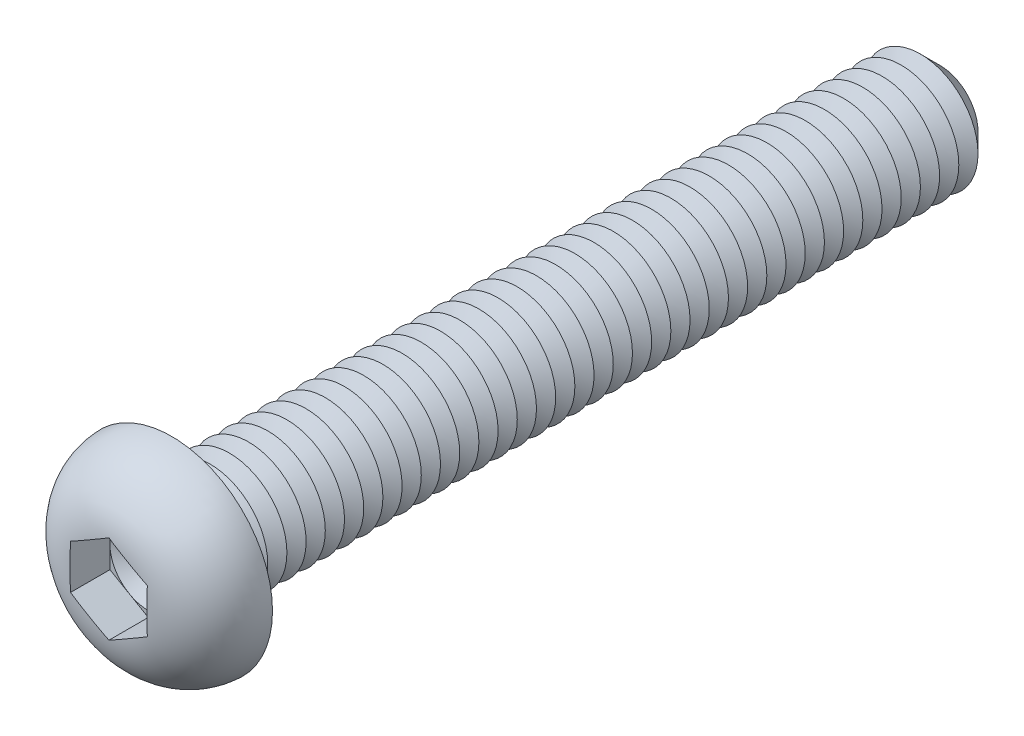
from build123d import *

# Parameters (mm, degrees)
CUT_EXTRUDE1_DEPTH  = 2.08
SKETCH4_R           = 3
BOSS_EXTRUDE1_DEPTH = 40
CHAMFER1_SIZE       = 1
LPATTERN1_COUNT     = 38
LPATTERN1_PITCH     = 1
FILLET2_R           = 0.5


with BuildPart() as part:
    # Sketch2 → Revolve1 (revolve)
    with BuildSketch(Plane(origin=(0, 0, 0), x_dir=(0, 0, -1), z_dir=(1, 0, 0)), mode=Mode.PRIVATE) as revolve1_sk:
        with BuildLine():
            Line((0, 0), (-3.3, 0))
            Line((-3.3, 0), (-3.3, 1.851470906))
            ThreePointArc((-3.3, 1.851470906), (-2.339262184, 4.220014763), (0, 5.25))
            Line((0, 5.25), (0, 0))
        make_face()
    revolve(revolve1_sk.sketch.rotate(Axis((0, 0, 47.934239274), (0, 0, -1)), 90), axis=Axis((0, 0, 47.934239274), (0, 0, -1)))

    # Sketch3 → Cut-Extrude1 (cut)
    with BuildSketch(Plane.XY.offset(3.3)):
        Polygon((0, 2.309401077), (-2, 1.154700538), (-2, -1.154700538), (0, -2.309401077), (2, -1.154700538), (2, 1.154700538), align=None)
    extrude(amount=-CUT_EXTRUDE1_DEPTH, mode=Mode.SUBTRACT)

    # Sketch4 → Boss-Extrude1 (add)
    with BuildSketch(Plane(origin=(0, 0, 0), x_dir=(-1, 0, 0), z_dir=(0, 0, -1))):
        Circle(SKETCH4_R)
    extrude(amount=BOSS_EXTRUDE1_DEPTH)

    # Chamfer1
    chamfer1_edges = [part.edges().sort_by_distance(p)[0] for p in [
        (3, 0, -40),
    ]]
    chamfer(chamfer1_edges, length=CHAMFER1_SIZE)

    # Sketch5 → Cut-Revolve1 (revolve, cut)
    with BuildSketch(Plane(origin=(0, 0, 0), x_dir=(0, 0, -1), z_dir=(1, 0, 0)), mode=Mode.PRIVATE) as cut_revolve1_sk:
        Polygon((1, 3), (2, 3), (1.5, 2.133974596), align=None)
    cut_revolve1 = revolve(cut_revolve1_sk.sketch.rotate(Axis((0, 0, 47.934239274), (0, 0, -1)), 90), axis=Axis((0, 0, 47.934239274), (0, 0, -1)), mode=Mode.SUBTRACT)

    # LPattern1: Cut-Revolve1 ×38
    with Locations(*[(0, 0, -i * LPATTERN1_PITCH) for i in range(1, LPATTERN1_COUNT)]):
        add(cut_revolve1, mode=Mode.SUBTRACT)

    # Fillet2
    fillet2_edges = [part.edges().sort_by_distance(p)[0] for p in [
        (3, 0, 0),
    ]]
    fillet(fillet2_edges, radius=FILLET2_R)

    # Cut-Extrude2 cone 1 section (on through the dimple's axis) → Cut-Extrude2 (revolve, cut)
    with BuildSketch(Plane(origin=(0, 0, 1.22), x_dir=(0, -1, 0), z_dir=(1, 0, 0))):
        Polygon((0, 0), (2, 0), (0, 1.154700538), align=None)
    revolve(axis=Axis((0, 0, 1.22), (0, 0, -1)), mode=Mode.SUBTRACT)


solid = part.part
